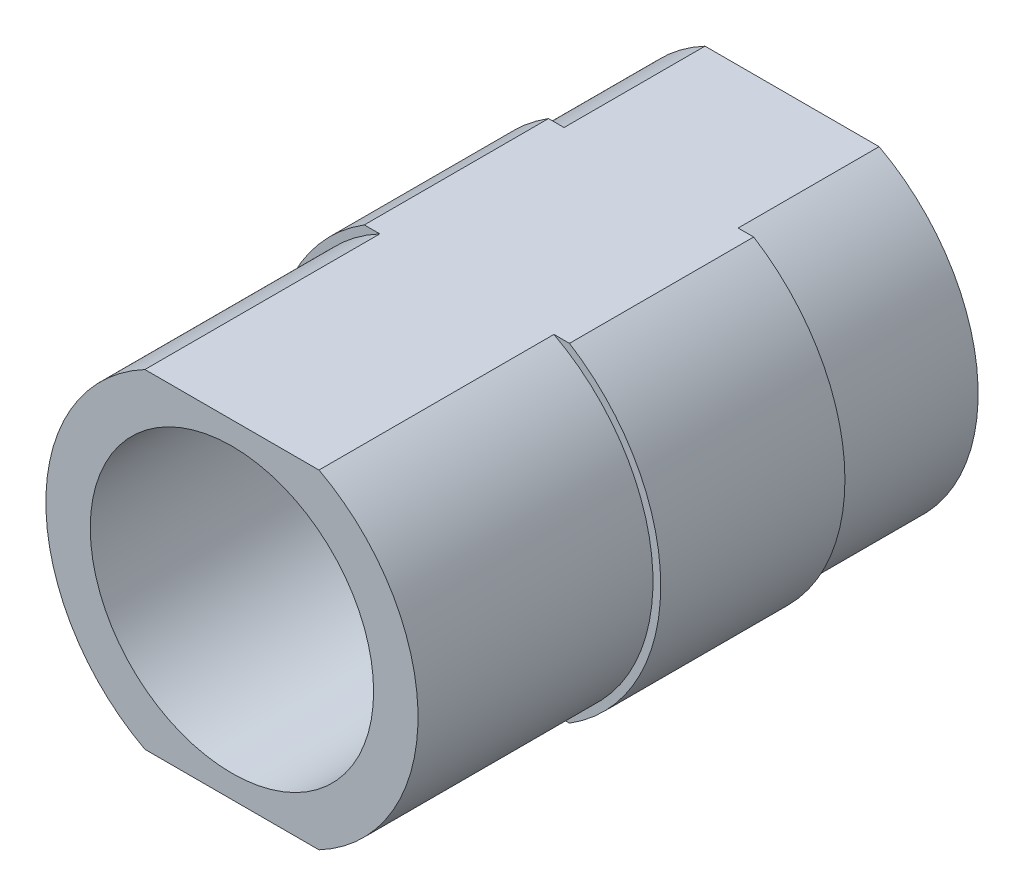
ISO-10303-21;
HEADER;
FILE_DESCRIPTION(('STEP AP214'),'2;1');
FILE_NAME('part.step','',(''),(''),'','','');
FILE_SCHEMA(('AUTOMOTIVE_DESIGN { 1 0 10303 214 1 1 1 1 }'));
ENDSEC;
DATA;
#1=APPLICATION_CONTEXT('core data for automotive mechanical design processes');
#2=APPLICATION_PROTOCOL_DEFINITION('international standard','automotive_design',2000,#1);
#3=PRODUCT_CONTEXT('',#1,'mechanical');
#4=PRODUCT('Part','Part','',(#3));
#5=PRODUCT_RELATED_PRODUCT_CATEGORY('part','',(#4));
#6=PRODUCT_DEFINITION_FORMATION('','',#4);
#7=PRODUCT_DEFINITION_CONTEXT('part definition',#1,'design');
#8=PRODUCT_DEFINITION('design','',#6,#7);
#9=PRODUCT_DEFINITION_SHAPE('','',#8);
#10=(LENGTH_UNIT() NAMED_UNIT(*) SI_UNIT(.MILLI.,.METRE.));
#11=(NAMED_UNIT(*) PLANE_ANGLE_UNIT() SI_UNIT($,.RADIAN.));
#12=(NAMED_UNIT(*) SI_UNIT($,.STERADIAN.) SOLID_ANGLE_UNIT());
#13=UNCERTAINTY_MEASURE_WITH_UNIT(LENGTH_MEASURE(1.E-05),#10,'distance_accuracy_value','');
#14=(GEOMETRIC_REPRESENTATION_CONTEXT(3) GLOBAL_UNCERTAINTY_ASSIGNED_CONTEXT((#13)) GLOBAL_UNIT_ASSIGNED_CONTEXT((#10,
#11,#12)) REPRESENTATION_CONTEXT('',''));
#15=CARTESIAN_POINT('',(0.,0.,0.));
#16=DIRECTION('',(0.,0.,1.));
#17=DIRECTION('',(1.,0.,0.));
#18=AXIS2_PLACEMENT_3D('',#15,#16,#17);
#19=CARTESIAN_POINT('',(0.,0.,11.92));
#20=DIRECTION('',(0.,0.,-1.));
#21=DIRECTION('',(-1.,0.,0.));
#22=AXIS2_PLACEMENT_3D('',#19,#20,#21);
#23=CYLINDRICAL_SURFACE('',#22,4.125);
#24=DIRECTION('',(0.,0.,1.));
#25=VECTOR('',#24,1.);
#26=CARTESIAN_POINT('',(-2.18303114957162,-3.5,0.));
#27=LINE('',#26,#25);
#28=CARTESIAN_POINT('',(-2.18303114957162,-3.5,3.));
#29=VERTEX_POINT('',#28);
#30=CARTESIAN_POINT('',(-2.18303114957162,-3.5,6.92));
#31=VERTEX_POINT('',#30);
#32=EDGE_CURVE('E132',#29,#31,#27,.T.);
#33=ORIENTED_EDGE('',*,*,#32,.T.);
#34=CARTESIAN_POINT('',(0.,0.,6.92));
#35=DIRECTION('',(0.,0.,1.));
#36=DIRECTION('',(1.,0.,0.));
#37=AXIS2_PLACEMENT_3D('',#34,#35,#36);
#38=CIRCLE('',#37,4.125);
#39=CARTESIAN_POINT('',(-2.18303114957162,3.5,6.92));
#40=VERTEX_POINT('',#39);
#41=EDGE_CURVE('E164',#40,#31,#38,.T.);
#42=ORIENTED_EDGE('',*,*,#41,.F.);
#43=DIRECTION('',(0.,0.,1.));
#44=VECTOR('',#43,1.);
#45=CARTESIAN_POINT('',(-2.18303114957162,3.5,0.));
#46=LINE('',#45,#44);
#47=CARTESIAN_POINT('',(-2.18303114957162,3.5,3.));
#48=VERTEX_POINT('',#47);
#49=EDGE_CURVE('E205',#48,#40,#46,.T.);
#50=ORIENTED_EDGE('',*,*,#49,.F.);
#51=CARTESIAN_POINT('',(0.,0.,3.));
#52=DIRECTION('',(0.,0.,-1.));
#53=DIRECTION('',(-1.,0.,0.));
#54=AXIS2_PLACEMENT_3D('',#51,#52,#53);
#55=CIRCLE('',#54,4.125);
#56=EDGE_CURVE('E151',#29,#48,#55,.T.);
#57=ORIENTED_EDGE('',*,*,#56,.F.);
#58=EDGE_LOOP('',(#33,#42,#50,#57));
#59=FACE_BOUND('',#58,.T.);
#60=ADVANCED_FACE('F33',(#59),#23,.T.);
#61=DIRECTION('',(0.,0.,1.));
#62=VECTOR('',#61,1.);
#63=CARTESIAN_POINT('',(2.18303114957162,-3.5,0.));
#64=LINE('',#63,#62);
#65=CARTESIAN_POINT('',(2.18303114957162,-3.5,3.));
#66=VERTEX_POINT('',#65);
#67=CARTESIAN_POINT('',(2.18303114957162,-3.5,6.92));
#68=VERTEX_POINT('',#67);
#69=EDGE_CURVE('E184',#66,#68,#64,.T.);
#70=ORIENTED_EDGE('',*,*,#69,.F.);
#71=CARTESIAN_POINT('',(2.18303114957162,3.5,3.));
#72=VERTEX_POINT('',#71);
#73=EDGE_CURVE('E152',#72,#66,#55,.T.);
#74=ORIENTED_EDGE('',*,*,#73,.F.);
#75=DIRECTION('',(0.,0.,1.));
#76=VECTOR('',#75,1.);
#77=CARTESIAN_POINT('',(2.18303114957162,3.5,0.));
#78=LINE('',#77,#76);
#79=CARTESIAN_POINT('',(2.18303114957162,3.5,6.92));
#80=VERTEX_POINT('',#79);
#81=EDGE_CURVE('E204',#72,#80,#78,.T.);
#82=ORIENTED_EDGE('',*,*,#81,.T.);
#83=EDGE_CURVE('E163',#68,#80,#38,.T.);
#84=ORIENTED_EDGE('',*,*,#83,.F.);
#85=EDGE_LOOP('',(#70,#74,#82,#84));
#86=FACE_BOUND('',#85,.T.);
#87=ADVANCED_FACE('F227',(#86),#23,.T.);
#88=CARTESIAN_POINT('',(0.,0.,0.));
#89=DIRECTION('',(0.,0.,1.));
#90=DIRECTION('',(1.,0.,0.));
#91=AXIS2_PLACEMENT_3D('',#88,#89,#90);
#92=PLANE('',#91);
#93=CARTESIAN_POINT('',(0.,0.,0.));
#94=DIRECTION('',(0.,0.,1.));
#95=DIRECTION('',(1.,0.,0.));
#96=AXIS2_PLACEMENT_3D('',#93,#94,#95);
#97=CIRCLE('',#96,3.015);
#98=CARTESIAN_POINT('',(3.015,0.,0.));
#99=VERTEX_POINT('',#98);
#100=EDGE_CURVE('E170',#99,#99,#97,.T.);
#101=ORIENTED_EDGE('',*,*,#100,.T.);
#102=EDGE_LOOP('',(#101));
#103=FACE_BOUND('',#102,.T.);
#104=DIRECTION('',(1.,0.,0.));
#105=VECTOR('',#104,1.);
#106=CARTESIAN_POINT('',(0.,-3.5,0.));
#107=LINE('',#106,#105);
#108=CARTESIAN_POINT('',(-1.85245782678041,-3.5,0.));
#109=VERTEX_POINT('',#108);
#110=CARTESIAN_POINT('',(1.85245782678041,-3.5,0.));
#111=VERTEX_POINT('',#110);
#112=EDGE_CURVE('E47',#109,#111,#107,.T.);
#113=ORIENTED_EDGE('',*,*,#112,.F.);
#114=CARTESIAN_POINT('',(0.,0.,0.));
#115=DIRECTION('',(0.,0.,-1.));
#116=DIRECTION('',(-1.,0.,0.));
#117=AXIS2_PLACEMENT_3D('',#114,#115,#116);
#118=CIRCLE('',#117,3.96);
#119=CARTESIAN_POINT('',(-1.85245782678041,3.5,0.));
#120=VERTEX_POINT('',#119);
#121=EDGE_CURVE('E128',#109,#120,#118,.T.);
#122=ORIENTED_EDGE('',*,*,#121,.T.);
#123=DIRECTION('',(1.,0.,0.));
#124=VECTOR('',#123,1.);
#125=CARTESIAN_POINT('',(0.,3.5,0.));
#126=LINE('',#125,#124);
#127=CARTESIAN_POINT('',(1.85245782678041,3.5,0.));
#128=VERTEX_POINT('',#127);
#129=EDGE_CURVE('E202',#120,#128,#126,.T.);
#130=ORIENTED_EDGE('',*,*,#129,.T.);
#131=EDGE_CURVE('E131',#128,#111,#118,.T.);
#132=ORIENTED_EDGE('',*,*,#131,.T.);
#133=EDGE_LOOP('',(#113,#122,#130,#132));
#134=FACE_BOUND('',#133,.T.);
#135=ADVANCED_FACE('F126',(#103,#134),#92,.F.);
#136=CARTESIAN_POINT('',(0.,0.,11.92));
#137=DIRECTION('',(0.,0.,1.));
#138=DIRECTION('',(1.,0.,0.));
#139=AXIS2_PLACEMENT_3D('',#136,#137,#138);
#140=PLANE('',#139);
#141=CARTESIAN_POINT('',(0.,0.,11.92));
#142=DIRECTION('',(0.,0.,1.));
#143=DIRECTION('',(1.,0.,0.));
#144=AXIS2_PLACEMENT_3D('',#141,#142,#143);
#145=CIRCLE('',#144,3.015);
#146=CARTESIAN_POINT('',(3.015,0.,11.92));
#147=VERTEX_POINT('',#146);
#148=EDGE_CURVE('E167',#147,#147,#145,.T.);
#149=ORIENTED_EDGE('',*,*,#148,.F.);
#150=EDGE_LOOP('',(#149));
#151=FACE_BOUND('',#150,.T.);
#152=CARTESIAN_POINT('',(0.,0.,11.92));
#153=DIRECTION('',(0.,0.,1.));
#154=DIRECTION('',(1.,0.,0.));
#155=AXIS2_PLACEMENT_3D('',#152,#153,#154);
#156=CIRCLE('',#155,3.96);
#157=CARTESIAN_POINT('',(-1.85245782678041,3.5,11.92));
#158=VERTEX_POINT('',#157);
#159=CARTESIAN_POINT('',(-1.85245782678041,-3.5,11.92));
#160=VERTEX_POINT('',#159);
#161=EDGE_CURVE('E156',#158,#160,#156,.T.);
#162=ORIENTED_EDGE('',*,*,#161,.T.);
#163=DIRECTION('',(1.,0.,0.));
#164=VECTOR('',#163,1.);
#165=CARTESIAN_POINT('',(0.,-3.5,11.92));
#166=LINE('',#165,#164);
#167=CARTESIAN_POINT('',(1.85245782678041,-3.5,11.92));
#168=VERTEX_POINT('',#167);
#169=EDGE_CURVE('E133',#160,#168,#166,.T.);
#170=ORIENTED_EDGE('',*,*,#169,.T.);
#171=CARTESIAN_POINT('',(1.85245782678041,3.5,11.92));
#172=VERTEX_POINT('',#171);
#173=EDGE_CURVE('E155',#168,#172,#156,.T.);
#174=ORIENTED_EDGE('',*,*,#173,.T.);
#175=DIRECTION('',(1.,0.,0.));
#176=VECTOR('',#175,1.);
#177=CARTESIAN_POINT('',(0.,3.5,11.92));
#178=LINE('',#177,#176);
#179=EDGE_CURVE('E199',#158,#172,#178,.T.);
#180=ORIENTED_EDGE('',*,*,#179,.F.);
#181=EDGE_LOOP('',(#162,#170,#174,#180));
#182=FACE_BOUND('',#181,.T.);
#183=ADVANCED_FACE('F231',(#151,#182),#140,.T.);
#184=CARTESIAN_POINT('',(0.,0.,6.92));
#185=DIRECTION('',(0.,0.,1.));
#186=DIRECTION('',(1.,0.,0.));
#187=AXIS2_PLACEMENT_3D('',#184,#185,#186);
#188=PLANE('',#187);
#189=ORIENTED_EDGE('',*,*,#41,.T.);
#190=DIRECTION('',(1.,0.,0.));
#191=VECTOR('',#190,1.);
#192=CARTESIAN_POINT('',(0.,-3.5,6.92));
#193=LINE('',#192,#191);
#194=CARTESIAN_POINT('',(-1.85245782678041,-3.5,6.92));
#195=VERTEX_POINT('',#194);
#196=EDGE_CURVE('E192',#31,#195,#193,.T.);
#197=ORIENTED_EDGE('',*,*,#196,.T.);
#198=CARTESIAN_POINT('',(0.,0.,6.92));
#199=DIRECTION('',(0.,0.,1.));
#200=DIRECTION('',(1.,0.,0.));
#201=AXIS2_PLACEMENT_3D('',#198,#199,#200);
#202=CIRCLE('',#201,3.96);
#203=CARTESIAN_POINT('',(-1.85245782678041,3.5,6.92));
#204=VERTEX_POINT('',#203);
#205=EDGE_CURVE('E160',#204,#195,#202,.T.);
#206=ORIENTED_EDGE('',*,*,#205,.F.);
#207=DIRECTION('',(1.,0.,0.));
#208=VECTOR('',#207,1.);
#209=CARTESIAN_POINT('',(0.,3.5,6.92));
#210=LINE('',#209,#208);
#211=EDGE_CURVE('E145',#40,#204,#210,.T.);
#212=ORIENTED_EDGE('',*,*,#211,.F.);
#213=EDGE_LOOP('',(#189,#197,#206,#212));
#214=FACE_BOUND('',#213,.T.);
#215=ADVANCED_FACE('F238',(#214),#188,.T.);
#216=CARTESIAN_POINT('',(1.85245782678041,-3.5,6.92));
#217=VERTEX_POINT('',#216);
#218=CARTESIAN_POINT('',(1.85245782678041,3.5,6.92));
#219=VERTEX_POINT('',#218);
#220=EDGE_CURVE('E159',#217,#219,#202,.T.);
#221=ORIENTED_EDGE('',*,*,#220,.F.);
#222=EDGE_CURVE('E196',#217,#68,#193,.T.);
#223=ORIENTED_EDGE('',*,*,#222,.T.);
#224=ORIENTED_EDGE('',*,*,#83,.T.);
#225=EDGE_CURVE('E139',#219,#80,#210,.T.);
#226=ORIENTED_EDGE('',*,*,#225,.F.);
#227=EDGE_LOOP('',(#221,#223,#224,#226));
#228=FACE_BOUND('',#227,.T.);
#229=ADVANCED_FACE('F223',(#228),#188,.T.);
#230=CARTESIAN_POINT('',(0.,0.,6.92));
#231=DIRECTION('',(0.,0.,1.));
#232=DIRECTION('',(1.,0.,0.));
#233=AXIS2_PLACEMENT_3D('',#230,#231,#232);
#234=CYLINDRICAL_SURFACE('',#233,3.96);
#235=ORIENTED_EDGE('',*,*,#173,.F.);
#236=DIRECTION('',(0.,0.,1.));
#237=VECTOR('',#236,1.);
#238=CARTESIAN_POINT('',(1.85245782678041,-3.5,6.92));
#239=LINE('',#238,#237);
#240=EDGE_CURVE('E195',#168,#217,#239,.F.);
#241=ORIENTED_EDGE('',*,*,#240,.T.);
#242=ORIENTED_EDGE('',*,*,#220,.T.);
#243=DIRECTION('',(0.,0.,1.));
#244=VECTOR('',#243,1.);
#245=CARTESIAN_POINT('',(1.85245782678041,3.5,6.92));
#246=LINE('',#245,#244);
#247=EDGE_CURVE('E143',#172,#219,#246,.F.);
#248=ORIENTED_EDGE('',*,*,#247,.F.);
#249=EDGE_LOOP('',(#235,#241,#242,#248));
#250=FACE_BOUND('',#249,.T.);
#251=ADVANCED_FACE('F229',(#250),#234,.T.);
#252=ORIENTED_EDGE('',*,*,#205,.T.);
#253=DIRECTION('',(0.,0.,1.));
#254=VECTOR('',#253,1.);
#255=CARTESIAN_POINT('',(-1.85245782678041,-3.5,6.92));
#256=LINE('',#255,#254);
#257=EDGE_CURVE('E186',#195,#160,#256,.T.);
#258=ORIENTED_EDGE('',*,*,#257,.T.);
#259=ORIENTED_EDGE('',*,*,#161,.F.);
#260=DIRECTION('',(0.,0.,1.));
#261=VECTOR('',#260,1.);
#262=CARTESIAN_POINT('',(-1.85245782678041,3.5,6.92));
#263=LINE('',#262,#261);
#264=EDGE_CURVE('E211',#204,#158,#263,.T.);
#265=ORIENTED_EDGE('',*,*,#264,.F.);
#266=EDGE_LOOP('',(#252,#258,#259,#265));
#267=FACE_BOUND('',#266,.T.);
#268=ADVANCED_FACE('F235',(#267),#234,.T.);
#269=CARTESIAN_POINT('',(0.,0.,3.));
#270=DIRECTION('',(0.,0.,-1.));
#271=DIRECTION('',(-1.,0.,0.));
#272=AXIS2_PLACEMENT_3D('',#269,#270,#271);
#273=PLANE('',#272);
#274=ORIENTED_EDGE('',*,*,#73,.T.);
#275=DIRECTION('',(-1.,0.,0.));
#276=VECTOR('',#275,1.);
#277=CARTESIAN_POINT('',(0.,-3.5,3.));
#278=LINE('',#277,#276);
#279=CARTESIAN_POINT('',(1.85245782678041,-3.5,3.));
#280=VERTEX_POINT('',#279);
#281=EDGE_CURVE('E179',#66,#280,#278,.T.);
#282=ORIENTED_EDGE('',*,*,#281,.T.);
#283=CARTESIAN_POINT('',(0.,0.,3.));
#284=DIRECTION('',(0.,0.,-1.));
#285=DIRECTION('',(-1.,0.,0.));
#286=AXIS2_PLACEMENT_3D('',#283,#284,#285);
#287=CIRCLE('',#286,3.96);
#288=CARTESIAN_POINT('',(1.85245782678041,3.5,3.));
#289=VERTEX_POINT('',#288);
#290=EDGE_CURVE('E148',#289,#280,#287,.T.);
#291=ORIENTED_EDGE('',*,*,#290,.F.);
#292=DIRECTION('',(-1.,0.,0.));
#293=VECTOR('',#292,1.);
#294=CARTESIAN_POINT('',(0.,3.5,3.));
#295=LINE('',#294,#293);
#296=EDGE_CURVE('E55',#72,#289,#295,.T.);
#297=ORIENTED_EDGE('',*,*,#296,.F.);
#298=EDGE_LOOP('',(#274,#282,#291,#297));
#299=FACE_BOUND('',#298,.T.);
#300=ADVANCED_FACE('F182',(#299),#273,.T.);
#301=CARTESIAN_POINT('',(-1.85245782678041,-3.5,3.));
#302=VERTEX_POINT('',#301);
#303=CARTESIAN_POINT('',(-1.85245782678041,3.5,3.));
#304=VERTEX_POINT('',#303);
#305=EDGE_CURVE('E141',#302,#304,#287,.T.);
#306=ORIENTED_EDGE('',*,*,#305,.F.);
#307=EDGE_CURVE('E120',#302,#29,#278,.T.);
#308=ORIENTED_EDGE('',*,*,#307,.T.);
#309=ORIENTED_EDGE('',*,*,#56,.T.);
#310=EDGE_CURVE('E210',#304,#48,#295,.T.);
#311=ORIENTED_EDGE('',*,*,#310,.F.);
#312=EDGE_LOOP('',(#306,#308,#309,#311));
#313=FACE_BOUND('',#312,.T.);
#314=ADVANCED_FACE('F247',(#313),#273,.T.);
#315=CARTESIAN_POINT('',(0.,0.,3.));
#316=DIRECTION('',(0.,0.,-1.));
#317=DIRECTION('',(-1.,0.,0.));
#318=AXIS2_PLACEMENT_3D('',#315,#316,#317);
#319=CYLINDRICAL_SURFACE('',#318,3.96);
#320=ORIENTED_EDGE('',*,*,#121,.F.);
#321=DIRECTION('',(0.,0.,-1.));
#322=VECTOR('',#321,1.);
#323=CARTESIAN_POINT('',(-1.85245782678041,-3.5,3.));
#324=LINE('',#323,#322);
#325=EDGE_CURVE('E11',#109,#302,#324,.F.);
#326=ORIENTED_EDGE('',*,*,#325,.T.);
#327=ORIENTED_EDGE('',*,*,#305,.T.);
#328=DIRECTION('',(0.,0.,-1.));
#329=VECTOR('',#328,1.);
#330=CARTESIAN_POINT('',(-1.85245782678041,3.5,3.));
#331=LINE('',#330,#329);
#332=EDGE_CURVE('E138',#120,#304,#331,.F.);
#333=ORIENTED_EDGE('',*,*,#332,.F.);
#334=EDGE_LOOP('',(#320,#326,#327,#333));
#335=FACE_BOUND('',#334,.T.);
#336=ADVANCED_FACE('F136',(#335),#319,.T.);
#337=ORIENTED_EDGE('',*,*,#290,.T.);
#338=DIRECTION('',(0.,0.,-1.));
#339=VECTOR('',#338,1.);
#340=CARTESIAN_POINT('',(1.85245782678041,-3.5,3.));
#341=LINE('',#340,#339);
#342=EDGE_CURVE('E40',#280,#111,#341,.T.);
#343=ORIENTED_EDGE('',*,*,#342,.T.);
#344=ORIENTED_EDGE('',*,*,#131,.F.);
#345=DIRECTION('',(0.,0.,-1.));
#346=VECTOR('',#345,1.);
#347=CARTESIAN_POINT('',(1.85245782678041,3.5,3.));
#348=LINE('',#347,#346);
#349=EDGE_CURVE('E173',#289,#128,#348,.T.);
#350=ORIENTED_EDGE('',*,*,#349,.F.);
#351=EDGE_LOOP('',(#337,#343,#344,#350));
#352=FACE_BOUND('',#351,.T.);
#353=ADVANCED_FACE('F176',(#352),#319,.T.);
#354=CARTESIAN_POINT('',(0.,0.,0.));
#355=DIRECTION('',(0.,0.,1.));
#356=DIRECTION('',(1.,0.,0.));
#357=AXIS2_PLACEMENT_3D('',#354,#355,#356);
#358=CYLINDRICAL_SURFACE('',#357,3.015);
#359=ORIENTED_EDGE('',*,*,#100,.F.);
#360=EDGE_LOOP('',(#359));
#361=FACE_BOUND('',#360,.T.);
#362=ORIENTED_EDGE('',*,*,#148,.T.);
#363=EDGE_LOOP('',(#362));
#364=FACE_BOUND('',#363,.T.);
#365=ADVANCED_FACE('F270',(#361,#364),#358,.F.);
#366=CARTESIAN_POINT('',(0.,3.5,0.));
#367=DIRECTION('',(0.,-1.,0.));
#368=DIRECTION('',(0.,0.,-1.));
#369=AXIS2_PLACEMENT_3D('',#366,#367,#368);
#370=PLANE('',#369);
#371=ORIENTED_EDGE('',*,*,#225,.T.);
#372=ORIENTED_EDGE('',*,*,#81,.F.);
#373=ORIENTED_EDGE('',*,*,#296,.T.);
#374=ORIENTED_EDGE('',*,*,#349,.T.);
#375=ORIENTED_EDGE('',*,*,#129,.F.);
#376=ORIENTED_EDGE('',*,*,#332,.T.);
#377=ORIENTED_EDGE('',*,*,#310,.T.);
#378=ORIENTED_EDGE('',*,*,#49,.T.);
#379=ORIENTED_EDGE('',*,*,#211,.T.);
#380=ORIENTED_EDGE('',*,*,#264,.T.);
#381=ORIENTED_EDGE('',*,*,#179,.T.);
#382=ORIENTED_EDGE('',*,*,#247,.T.);
#383=EDGE_LOOP('',(#371,#372,#373,#374,#375,#376,#377,#378,#379,#380,#381,#382));
#384=FACE_BOUND('',#383,.T.);
#385=ADVANCED_FACE('F217',(#384),#370,.F.);
#386=CARTESIAN_POINT('',(0.,-3.5,0.));
#387=DIRECTION('',(0.,-1.,0.));
#388=DIRECTION('',(0.,0.,-1.));
#389=AXIS2_PLACEMENT_3D('',#386,#387,#388);
#390=PLANE('',#389);
#391=ORIENTED_EDGE('',*,*,#240,.F.);
#392=ORIENTED_EDGE('',*,*,#169,.F.);
#393=ORIENTED_EDGE('',*,*,#257,.F.);
#394=ORIENTED_EDGE('',*,*,#196,.F.);
#395=ORIENTED_EDGE('',*,*,#32,.F.);
#396=ORIENTED_EDGE('',*,*,#307,.F.);
#397=ORIENTED_EDGE('',*,*,#325,.F.);
#398=ORIENTED_EDGE('',*,*,#112,.T.);
#399=ORIENTED_EDGE('',*,*,#342,.F.);
#400=ORIENTED_EDGE('',*,*,#281,.F.);
#401=ORIENTED_EDGE('',*,*,#69,.T.);
#402=ORIENTED_EDGE('',*,*,#222,.F.);
#403=EDGE_LOOP('',(#391,#392,#393,#394,#395,#396,#397,#398,#399,#400,#401,#402));
#404=FACE_BOUND('',#403,.T.);
#405=ADVANCED_FACE('F118',(#404),#390,.T.);
#406=CLOSED_SHELL('',(#60,#87,#135,#183,#215,#229,#251,#268,#300,#314,#336,#353,#365,#385,#405));
#407=MANIFOLD_SOLID_BREP('B2',#406);
#408=ADVANCED_BREP_SHAPE_REPRESENTATION('',(#18,#407),#14);
#409=SHAPE_DEFINITION_REPRESENTATION(#9,#408);
ENDSEC;
END-ISO-10303-21;
